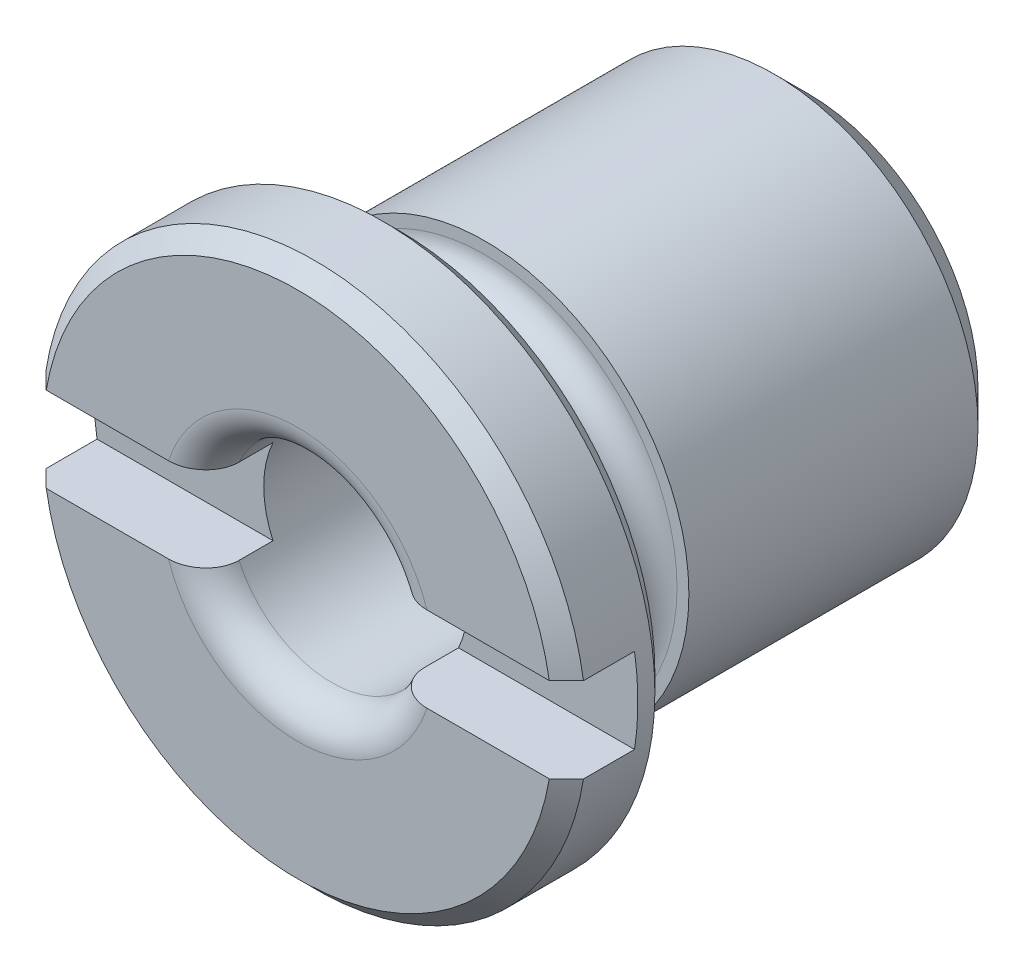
ISO-10303-21;
HEADER;
FILE_DESCRIPTION(('STEP AP214'),'2;1');
FILE_NAME('part.step','',(''),(''),'','','');
FILE_SCHEMA(('AUTOMOTIVE_DESIGN { 1 0 10303 214 1 1 1 1 }'));
ENDSEC;
DATA;
#1=APPLICATION_CONTEXT('core data for automotive mechanical design processes');
#2=APPLICATION_PROTOCOL_DEFINITION('international standard','automotive_design',2000,#1);
#3=PRODUCT_CONTEXT('',#1,'mechanical');
#4=PRODUCT('Part','Part','',(#3));
#5=PRODUCT_RELATED_PRODUCT_CATEGORY('part','',(#4));
#6=PRODUCT_DEFINITION_FORMATION('','',#4);
#7=PRODUCT_DEFINITION_CONTEXT('part definition',#1,'design');
#8=PRODUCT_DEFINITION('design','',#6,#7);
#9=PRODUCT_DEFINITION_SHAPE('','',#8);
#10=(LENGTH_UNIT() NAMED_UNIT(*) SI_UNIT(.MILLI.,.METRE.));
#11=(NAMED_UNIT(*) PLANE_ANGLE_UNIT() SI_UNIT($,.RADIAN.));
#12=(NAMED_UNIT(*) SI_UNIT($,.STERADIAN.) SOLID_ANGLE_UNIT());
#13=UNCERTAINTY_MEASURE_WITH_UNIT(LENGTH_MEASURE(1.E-05),#10,'distance_accuracy_value','');
#14=(GEOMETRIC_REPRESENTATION_CONTEXT(3) GLOBAL_UNCERTAINTY_ASSIGNED_CONTEXT((#13)) GLOBAL_UNIT_ASSIGNED_CONTEXT((#10,
#11,#12)) REPRESENTATION_CONTEXT('',''));
#15=CARTESIAN_POINT('',(0.,0.,0.));
#16=DIRECTION('',(0.,0.,1.));
#17=DIRECTION('',(1.,0.,0.));
#18=AXIS2_PLACEMENT_3D('',#15,#16,#17);
#19=CARTESIAN_POINT('',(0.,0.,-9.));
#20=DIRECTION('',(0.,0.,-1.));
#21=DIRECTION('',(0.00423805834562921,0.999991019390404,0.));
#22=AXIS2_PLACEMENT_3D('',#19,#20,#21);
#23=PLANE('',#22);
#24=CARTESIAN_POINT('',(0.,0.,-9.));
#25=DIRECTION('',(0.,0.,-1.));
#26=DIRECTION('',(-1.,0.,0.));
#27=AXIS2_PLACEMENT_3D('',#24,#25,#26);
#28=CIRCLE('',#27,4.);
#29=CARTESIAN_POINT('',(-4.,0.,-9.));
#30=VERTEX_POINT('',#29);
#31=EDGE_CURVE('E211',#30,#30,#28,.T.);
#32=ORIENTED_EDGE('',*,*,#31,.T.);
#33=EDGE_LOOP('',(#32));
#34=FACE_BOUND('',#33,.T.);
#35=ADVANCED_FACE('F14',(#34),#23,.T.);
#36=CARTESIAN_POINT('',(0.,0.,-3.5));
#37=DIRECTION('',(0.,0.,-1.));
#38=DIRECTION('',(-1.,0.,0.));
#39=AXIS2_PLACEMENT_3D('',#36,#37,#38);
#40=PLANE('',#39);
#41=CARTESIAN_POINT('',(0.,0.,-3.5));
#42=DIRECTION('',(0.,0.,-1.));
#43=DIRECTION('',(-1.,0.,0.));
#44=AXIS2_PLACEMENT_3D('',#41,#42,#43);
#45=CIRCLE('',#44,3.);
#46=CARTESIAN_POINT('',(-3.,0.,-3.5));
#47=VERTEX_POINT('',#46);
#48=EDGE_CURVE('E209',#47,#47,#45,.T.);
#49=ORIENTED_EDGE('',*,*,#48,.F.);
#50=EDGE_LOOP('',(#49));
#51=FACE_BOUND('',#50,.T.);
#52=ADVANCED_FACE('F193',(#51),#40,.F.);
#53=CARTESIAN_POINT('',(0.,0.,-17.5262382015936));
#54=DIRECTION('',(0.,0.,-1.));
#55=DIRECTION('',(-1.,0.,0.));
#56=AXIS2_PLACEMENT_3D('',#53,#54,#55);
#57=CYLINDRICAL_SURFACE('',#56,3.);
#58=DIRECTION('',(0.,0.,-1.));
#59=VECTOR('',#58,1.);
#60=CARTESIAN_POINT('',(-2.72717802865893,-1.25,-17.5262382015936));
#61=LINE('',#60,#59);
#62=CARTESIAN_POINT('',(-2.72717802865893,-1.25,1.));
#63=VERTEX_POINT('',#62);
#64=CARTESIAN_POINT('',(-2.72717802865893,-1.25,2.));
#65=VERTEX_POINT('',#64);
#66=EDGE_CURVE('E292',#63,#65,#61,.F.);
#67=ORIENTED_EDGE('',*,*,#66,.T.);
#68=CARTESIAN_POINT('',(0.,0.,2.));
#69=DIRECTION('',(0.,0.,-1.));
#70=DIRECTION('',(-1.,0.,0.));
#71=AXIS2_PLACEMENT_3D('',#68,#69,#70);
#72=CIRCLE('',#71,3.);
#73=CARTESIAN_POINT('',(2.72717802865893,-1.25,2.));
#74=VERTEX_POINT('',#73);
#75=EDGE_CURVE('E303',#65,#74,#72,.F.);
#76=ORIENTED_EDGE('',*,*,#75,.T.);
#77=DIRECTION('',(0.,0.,-1.));
#78=VECTOR('',#77,1.);
#79=CARTESIAN_POINT('',(2.72717802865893,-1.25,-17.5262382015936));
#80=LINE('',#79,#78);
#81=CARTESIAN_POINT('',(2.72717802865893,-1.25,1.));
#82=VERTEX_POINT('',#81);
#83=EDGE_CURVE('E290',#74,#82,#80,.T.);
#84=ORIENTED_EDGE('',*,*,#83,.T.);
#85=CARTESIAN_POINT('',(0.,0.,1.));
#86=DIRECTION('',(0.,0.,-1.));
#87=DIRECTION('',(0.,-1.,0.));
#88=AXIS2_PLACEMENT_3D('',#85,#86,#87);
#89=CIRCLE('',#88,3.);
#90=CARTESIAN_POINT('',(2.72717802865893,1.25,1.));
#91=VERTEX_POINT('',#90);
#92=EDGE_CURVE('E218',#82,#91,#89,.F.);
#93=ORIENTED_EDGE('',*,*,#92,.T.);
#94=DIRECTION('',(0.,0.,-1.));
#95=VECTOR('',#94,1.);
#96=CARTESIAN_POINT('',(2.72717802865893,1.25,-17.5262382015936));
#97=LINE('',#96,#95);
#98=CARTESIAN_POINT('',(2.72717802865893,1.25,2.));
#99=VERTEX_POINT('',#98);
#100=EDGE_CURVE('E285',#91,#99,#97,.F.);
#101=ORIENTED_EDGE('',*,*,#100,.T.);
#102=CARTESIAN_POINT('',(0.,0.,2.));
#103=DIRECTION('',(0.,0.,-1.));
#104=DIRECTION('',(-1.,0.,0.));
#105=AXIS2_PLACEMENT_3D('',#102,#103,#104);
#106=CIRCLE('',#105,3.);
#107=CARTESIAN_POINT('',(-2.72717802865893,1.25,2.));
#108=VERTEX_POINT('',#107);
#109=EDGE_CURVE('E305',#99,#108,#106,.F.);
#110=ORIENTED_EDGE('',*,*,#109,.T.);
#111=DIRECTION('',(0.,0.,-1.));
#112=VECTOR('',#111,1.);
#113=CARTESIAN_POINT('',(-2.72717802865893,1.25,-17.5262382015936));
#114=LINE('',#113,#112);
#115=CARTESIAN_POINT('',(-2.72717802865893,1.25,1.));
#116=VERTEX_POINT('',#115);
#117=EDGE_CURVE('E283',#108,#116,#114,.T.);
#118=ORIENTED_EDGE('',*,*,#117,.T.);
#119=EDGE_CURVE('E294',#116,#63,#89,.F.);
#120=ORIENTED_EDGE('',*,*,#119,.T.);
#121=EDGE_LOOP('',(#67,#76,#84,#93,#101,#110,#118,#120));
#122=FACE_BOUND('',#121,.T.);
#123=ORIENTED_EDGE('',*,*,#48,.T.);
#124=EDGE_LOOP('',(#123));
#125=FACE_BOUND('',#124,.T.);
#126=ADVANCED_FACE('F195',(#122,#125),#57,.F.);
#127=CARTESIAN_POINT('',(13.,-1.25,3.));
#128=DIRECTION('',(0.,-1.,0.));
#129=DIRECTION('',(0.,0.,1.));
#130=AXIS2_PLACEMENT_3D('',#127,#128,#129);
#131=PLANE('',#130);
#132=DIRECTION('',(-1.,0.,0.));
#133=VECTOR('',#132,1.);
#134=CARTESIAN_POINT('',(13.,-1.25,3.));
#135=LINE('',#134,#133);
#136=CARTESIAN_POINT('',(-3.79967103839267,-1.25,3.));
#137=VERTEX_POINT('',#136);
#138=CARTESIAN_POINT('',(-7.39509972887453,-1.25,3.));
#139=VERTEX_POINT('',#138);
#140=EDGE_CURVE('E271',#137,#139,#135,.T.);
#141=ORIENTED_EDGE('',*,*,#140,.F.);
#142=CARTESIAN_POINT('',(-3.79967103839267,-1.25,3.));
#143=CARTESIAN_POINT('',(-3.73678690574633,-1.25,3.00003379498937));
#144=CARTESIAN_POINT('',(-3.67392791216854,-1.25,2.99464950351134));
#145=CARTESIAN_POINT('',(-3.54999060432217,-1.25,2.97346188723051));
#146=CARTESIAN_POINT('',(-3.48891220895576,-1.25,2.95765903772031));
#147=CARTESIAN_POINT('',(-3.37024357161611,-1.25,2.91604545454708));
#148=CARTESIAN_POINT('',(-3.31265432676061,-1.25,2.8902318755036));
#149=CARTESIAN_POINT('',(-3.20267254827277,-1.25,2.82922762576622));
#150=CARTESIAN_POINT('',(-3.15027930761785,-1.25,2.79403823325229));
#151=CARTESIAN_POINT('',(-3.05285820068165,-1.25,2.71545576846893));
#152=CARTESIAN_POINT('',(-3.00776488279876,-1.25,2.6721440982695));
#153=CARTESIAN_POINT('',(-2.92604994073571,-1.25,2.57811291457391));
#154=CARTESIAN_POINT('',(-2.88942752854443,-1.25,2.52739409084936));
#155=CARTESIAN_POINT('',(-2.82829645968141,-1.25,2.42326776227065));
#156=CARTESIAN_POINT('',(-2.80318285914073,-1.25,2.37021564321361));
#157=CARTESIAN_POINT('',(-2.76321292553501,-1.25,2.26042484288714));
#158=CARTESIAN_POINT('',(-2.74833564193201,-1.25,2.20369395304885));
#159=CARTESIAN_POINT('',(-2.73505696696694,-1.25,2.12197393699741));
#160=CARTESIAN_POINT('',(-2.73210426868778,-1.25,2.09765852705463));
#161=CARTESIAN_POINT('',(-2.72816622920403,-1.25,2.04890006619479));
#162=CARTESIAN_POINT('',(-2.7271783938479,-1.25,2.0244572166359));
#163=CARTESIAN_POINT('',(-2.72717802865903,-1.25,2.));
#164=B_SPLINE_CURVE_WITH_KNOTS('',3,(#142,#143,#144,#145,#146,#147,#148,#149,#150,#151,#152,
#153,#154,#155,#156,#157,#158,#159,#160,#161,#162,#163),.UNSPECIFIED.,.F.,.F.,(4,2,2,2,2,2,2,2,
2,2,4),(0.,0.18838914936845,0.376769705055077,0.565203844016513,0.753612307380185,
0.940224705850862,1.12681973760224,1.30197682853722,1.47677435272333,1.55019101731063,
1.62351442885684),.UNSPECIFIED.);
#165=EDGE_CURVE('E317',#137,#65,#164,.T.);
#166=ORIENTED_EDGE('',*,*,#165,.T.);
#167=ORIENTED_EDGE('',*,*,#66,.F.);
#168=DIRECTION('',(-1.,0.,0.));
#169=VECTOR('',#168,1.);
#170=CARTESIAN_POINT('',(13.,-1.25,1.));
#171=LINE('',#170,#169);
#172=CARTESIAN_POINT('',(-7.90174031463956,-1.25,1.));
#173=VERTEX_POINT('',#172);
#174=EDGE_CURVE('E276',#63,#173,#171,.T.);
#175=ORIENTED_EDGE('',*,*,#174,.T.);
#176=DIRECTION('',(0.,0.,-1.));
#177=VECTOR('',#176,1.);
#178=CARTESIAN_POINT('',(-7.90174031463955,-1.25,-17.5262382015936));
#179=LINE('',#178,#177);
#180=CARTESIAN_POINT('',(-7.90174031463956,-1.25,2.5));
#181=VERTEX_POINT('',#180);
#182=EDGE_CURVE('E245',#181,#173,#179,.T.);
#183=ORIENTED_EDGE('',*,*,#182,.F.);
#184=CARTESIAN_POINT('',(27.9343800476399,-1.25,-17.4623333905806));
#185=CARTESIAN_POINT('',(26.8800476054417,-1.25,-16.4090660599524));
#186=CARTESIAN_POINT('',(25.8256661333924,-1.25,-15.355847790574));
#187=CARTESIAN_POINT('',(23.7166397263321,-1.25,-13.2494953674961));
#188=CARTESIAN_POINT('',(22.6619947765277,-1.25,-12.1963612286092));
#189=CARTESIAN_POINT('',(20.5477273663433,-1.25,-10.0856221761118));
#190=CARTESIAN_POINT('',(19.4881037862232,-1.25,-9.02801838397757));
#191=CARTESIAN_POINT('',(17.8984046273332,-1.25,-7.44196538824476));
#192=CARTESIAN_POINT('',(17.36848302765,-1.25,-6.91336185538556));
#193=CARTESIAN_POINT('',(16.3085054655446,-1.25,-5.85629248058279));
#194=CARTESIAN_POINT('',(15.7784495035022,-1.25,-5.32782663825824));
#195=CARTESIAN_POINT('',(14.7182251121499,-1.25,-4.27114658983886));
#196=CARTESIAN_POINT('',(14.1880567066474,-1.25,-3.74293235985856));
#197=CARTESIAN_POINT('',(13.1274621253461,-1.25,-2.68675172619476));
#198=CARTESIAN_POINT('',(12.5970359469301,-1.25,-2.15878532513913));
#199=CARTESIAN_POINT('',(11.5356810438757,-1.25,-1.1030783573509));
#200=CARTESIAN_POINT('',(11.0047522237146,-1.25,-0.575337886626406));
#201=CARTESIAN_POINT('',(9.94236178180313,-1.25,0.479566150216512));
#202=CARTESIAN_POINT('',(9.41090018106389,-1.25,1.00672973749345));
#203=CARTESIAN_POINT('',(8.34924431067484,-1.25,2.05803306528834));
#204=CARTESIAN_POINT('',(7.81905361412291,-1.25,2.58217641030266));
#205=CARTESIAN_POINT('',(7.02253617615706,-1.25,3.36722003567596));
#206=CARTESIAN_POINT('',(6.7568056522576,-1.25,3.62872509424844));
#207=CARTESIAN_POINT('',(6.22478106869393,-1.25,4.15115411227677));
#208=CARTESIAN_POINT('',(5.95848701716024,-1.25,4.41207808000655));
#209=CARTESIAN_POINT('',(5.42522113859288,-1.25,4.93293108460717));
#210=CARTESIAN_POINT('',(5.15824977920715,-1.25,5.19286060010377));
#211=CARTESIAN_POINT('',(4.62302560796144,-1.25,5.71143000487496));
#212=CARTESIAN_POINT('',(4.35477272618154,-1.25,5.97006982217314));
#213=CARTESIAN_POINT('',(3.95082930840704,-1.25,6.35632620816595));
#214=CARTESIAN_POINT('',(3.81593807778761,-1.25,6.48477821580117));
#215=CARTESIAN_POINT('',(3.54543320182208,-1.25,6.74091878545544));
#216=CARTESIAN_POINT('',(3.40981956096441,-1.25,6.8686073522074));
#217=CARTESIAN_POINT('',(3.13760998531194,-1.25,7.12290966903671));
#218=CARTESIAN_POINT('',(3.00101413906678,-1.25,7.24952351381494));
#219=CARTESIAN_POINT('',(2.72640859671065,-1.25,7.50120683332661));
#220=CARTESIAN_POINT('',(2.58839895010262,-1.25,7.62627636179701));
#221=CARTESIAN_POINT('',(2.41149252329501,-1.25,7.78384336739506));
#222=CARTESIAN_POINT('',(2.37358311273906,-1.25,7.81744965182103));
#223=CARTESIAN_POINT('',(2.29758289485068,-1.25,7.88445711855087));
#224=CARTESIAN_POINT('',(2.25949208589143,-1.25,7.91785829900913));
#225=CARTESIAN_POINT('',(2.14490683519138,-1.25,8.01771925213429));
#226=CARTESIAN_POINT('',(2.0681069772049,-1.25,8.08382982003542));
#227=CARTESIAN_POINT('',(1.91297050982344,-1.25,8.21521518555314));
#228=CARTESIAN_POINT('',(1.83462731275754,-1.25,8.28048222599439));
#229=CARTESIAN_POINT('',(1.67654078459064,-1.25,8.4092623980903));
#230=CARTESIAN_POINT('',(1.5967978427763,-1.25,8.47277600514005));
#231=CARTESIAN_POINT('',(1.43449799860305,-1.25,8.59800601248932));
#232=CARTESIAN_POINT('',(1.35191980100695,-1.25,8.65969498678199));
#233=CARTESIAN_POINT('',(1.18390135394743,-1.25,8.77935164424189));
#234=CARTESIAN_POINT('',(1.09845744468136,-1.25,8.83731426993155));
#235=CARTESIAN_POINT('',(0.924443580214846,-1.25,8.94676771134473));
#236=CARTESIAN_POINT('',(0.835904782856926,-1.25,8.99830742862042));
#237=CARTESIAN_POINT('',(0.653805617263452,-1.25,9.09149723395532));
#238=CARTESIAN_POINT('',(0.560261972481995,-1.25,9.13317800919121));
#239=CARTESIAN_POINT('',(0.426967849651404,-1.25,9.17954037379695));
#240=CARTESIAN_POINT('',(0.38964389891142,-1.25,9.19118167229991));
#241=CARTESIAN_POINT('',(0.314212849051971,-1.25,9.21162478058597));
#242=CARTESIAN_POINT('',(0.276105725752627,-1.25,9.22042650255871));
#243=CARTESIAN_POINT('',(0.199412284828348,-1.25,9.23475182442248));
#244=CARTESIAN_POINT('',(0.160828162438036,-1.25,9.24028701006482));
#245=CARTESIAN_POINT('',(0.0833175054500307,-1.25,9.24781985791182));
#246=CARTESIAN_POINT('',(0.0443910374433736,-1.25,9.24981819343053));
#247=CARTESIAN_POINT('',(-0.0336350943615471,-1.25,9.25015867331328));
#248=CARTESIAN_POINT('',(-0.0727348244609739,-1.25,9.24848606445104));
#249=CARTESIAN_POINT('',(-0.150612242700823,-1.25,9.24155698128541));
#250=CARTESIAN_POINT('',(-0.1893899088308,-1.25,9.23630026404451));
#251=CARTESIAN_POINT('',(-0.266469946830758,-1.25,9.22247794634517));
#252=CARTESIAN_POINT('',(-0.304770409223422,-1.25,9.21390185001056));
#253=CARTESIAN_POINT('',(-0.380596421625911,-1.25,9.19385439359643));
#254=CARTESIAN_POINT('',(-0.418121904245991,-1.25,9.18238278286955));
#255=CARTESIAN_POINT('',(-0.535070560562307,-1.25,9.14236918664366));
#256=CARTESIAN_POINT('',(-0.612972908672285,-1.25,9.1093833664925));
#257=CARTESIAN_POINT('',(-0.765172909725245,-1.25,9.0359212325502));
#258=CARTESIAN_POINT('',(-0.839463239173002,-1.25,8.99543044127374));
#259=CARTESIAN_POINT('',(-0.985690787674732,-1.25,8.90922028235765));
#260=CARTESIAN_POINT('',(-1.05760516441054,-1.25,8.86346263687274));
#261=CARTESIAN_POINT('',(-1.16373455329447,-1.25,8.79234173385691));
#262=CARTESIAN_POINT('',(-1.19880604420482,-1.25,8.76823152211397));
#263=CARTESIAN_POINT('',(-1.26845472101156,-1.25,8.71930841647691));
#264=CARTESIAN_POINT('',(-1.30303192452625,-1.25,8.69449554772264));
#265=CARTESIAN_POINT('',(-1.41266915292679,-1.25,8.61440156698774));
#266=CARTESIAN_POINT('',(-1.48691997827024,-1.25,8.55801372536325));
#267=CARTESIAN_POINT('',(-1.63390691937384,-1.25,8.44329142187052));
#268=CARTESIAN_POINT('',(-1.7066428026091,-1.25,8.38495666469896));
#269=CARTESIAN_POINT('',(-1.85099259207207,-1.25,8.26685180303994));
#270=CARTESIAN_POINT('',(-1.92260596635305,-1.25,8.20708105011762));
#271=CARTESIAN_POINT('',(-2.06494026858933,-1.25,8.08648452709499));
#272=CARTESIAN_POINT('',(-2.13566116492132,-1.25,8.02565871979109));
#273=CARTESIAN_POINT('',(-2.34702175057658,-1.25,7.84177923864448));
#274=CARTESIAN_POINT('',(-2.48661620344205,-1.25,7.71752553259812));
#275=CARTESIAN_POINT('',(-2.76397886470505,-1.25,7.46708552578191));
#276=CARTESIAN_POINT('',(-2.90174756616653,-1.25,7.34089976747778));
#277=CARTESIAN_POINT('',(-3.17560264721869,-1.25,7.08763269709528));
#278=CARTESIAN_POINT('',(-3.31169311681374,-1.25,6.96055580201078));
#279=CARTESIAN_POINT('',(-3.58302052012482,-1.25,6.70547691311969));
#280=CARTESIAN_POINT('',(-3.71825739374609,-1.25,6.57747485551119));
#281=CARTESIAN_POINT('',(-3.9879571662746,-1.25,6.32093623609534));
#282=CARTESIAN_POINT('',(-4.12242071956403,-1.25,6.19240036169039));
#283=CARTESIAN_POINT('',(-4.39086416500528,-1.25,5.93483121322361));
#284=CARTESIAN_POINT('',(-4.52484406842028,-1.25,5.8057979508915));
#285=CARTESIAN_POINT('',(-4.92512166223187,-1.25,5.41920199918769));
#286=CARTESIAN_POINT('',(-5.19087495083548,-1.25,5.16107581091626));
#287=CARTESIAN_POINT('',(-5.72146030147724,-1.25,4.64387793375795));
#288=CARTESIAN_POINT('',(-5.9862923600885,-1.25,4.38480624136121));
#289=CARTESIAN_POINT('',(-6.77988063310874,-1.25,3.60664685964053));
#290=CARTESIAN_POINT('',(-7.30771950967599,-1.25,3.08662403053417));
#291=CARTESIAN_POINT('',(-8.36237458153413,-1.25,2.0451104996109));
#292=CARTESIAN_POINT('',(-8.88919026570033,-1.25,1.52361928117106));
#293=CARTESIAN_POINT('',(-9.94207527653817,-1.25,0.479892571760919));
#294=CARTESIAN_POINT('',(-10.4681446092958,-1.25,-0.0423429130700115));
#295=CARTESIAN_POINT('',(-11.5199752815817,-1.25,-1.08744281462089));
#296=CARTESIAN_POINT('',(-12.0457364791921,-1.25,-1.61030737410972));
#297=CARTESIAN_POINT('',(-13.0969425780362,-1.25,-2.65635663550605));
#298=CARTESIAN_POINT('',(-13.6223874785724,-1.25,-3.17954133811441));
#299=CARTESIAN_POINT('',(-15.1982511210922,-1.25,-4.74928460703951));
#300=CARTESIAN_POINT('',(-16.248340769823,-1.25,-5.79617351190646));
#301=CARTESIAN_POINT('',(-18.617113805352,-1.25,-8.15879167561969));
#302=CARTESIAN_POINT('',(-19.9356606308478,-1.25,-9.47465781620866));
#303=CARTESIAN_POINT('',(-22.5723454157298,-1.25,-12.1068003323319));
#304=CARTESIAN_POINT('',(-23.8904833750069,-1.25,-13.4230767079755));
#305=CARTESIAN_POINT('',(-27.8446847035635,-1.25,-17.3724153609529));
#306=CARTESIAN_POINT('',(-30.4803870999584,-1.25,-20.0058390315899));
#307=CARTESIAN_POINT('',(-35.7492026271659,-1.25,-25.2709182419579));
#308=CARTESIAN_POINT('',(-38.3823160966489,-1.25,-27.9025734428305));
#309=CARTESIAN_POINT('',(-43.6481495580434,-1.25,-33.1659789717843));
#310=CARTESIAN_POINT('',(-46.2808695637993,-1.25,-35.7977292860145));
#311=CARTESIAN_POINT('',(-48.9135498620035,-1.25,-38.4295193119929));
#312=B_SPLINE_CURVE_WITH_KNOTS('',3,(#184,#185,#186,#187,#188,#189,#190,#191,#192,#193,#194,
#195,#196,#197,#198,#199,#200,#201,#202,#203,#204,#205,#206,#207,#208,#209,#210,#211,#212,#213,
#214,#215,#216,#217,#218,#219,#220,#221,#222,#223,#224,#225,#226,#227,#228,#229,#230,#231,#232,
#233,#234,#235,#236,#237,#238,#239,#240,#241,#242,#243,#244,#245,#246,#247,#248,#249,#250,#251,
#252,#253,#254,#255,#256,#257,#258,#259,#260,#261,#262,#263,#264,#265,#266,#267,#268,#269,#270,
#271,#272,#273,#274,#275,#276,#277,#278,#279,#280,#281,#282,#283,#284,#285,#286,#287,#288,#289,
#290,#291,#292,#293,#294,#295,#296,#297,#298,#299,#300,#301,#302,#303,#304,#305,#306,#307,#308,
#309,#310,#311),.UNSPECIFIED.,.F.,.F.,(4,2,2,2,2,2,2,2,2,2,2,2,2,2,2,2,2,2,2,2,2,2,2,2,2,2,2,2,
2,2,2,2,2,2,2,2,2,2,2,2,2,2,2,2,2,2,2,2,2,2,2,2,2,2,2,2,2,2,2,2,2,2,2,4),(0.,4.47089486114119,
8.94217065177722,13.4334901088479,15.6789627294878,17.9244290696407,20.169601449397,
22.4147971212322,24.6605837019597,26.9062849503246,29.1428996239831,30.2613705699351,
31.3798254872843,32.4976488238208,33.6155338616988,34.174334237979,34.7331311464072,
35.2918782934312,35.8506059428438,36.002587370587,36.1545701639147,36.4585655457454,
36.7644519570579,37.0702546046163,37.3794183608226,37.6889932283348,37.9960447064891,
38.3021274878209,38.4193280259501,38.5365321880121,38.65331811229,38.7700818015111,
38.8873156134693,39.0045573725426,39.1221729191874,39.2397986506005,39.4928942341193,
39.7464832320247,40.0020479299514,40.1297212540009,40.2573900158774,40.5370425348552,
40.8167376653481,41.0965615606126,41.3763953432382,41.9370109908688,42.4974720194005,
43.0560552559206,43.6146773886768,44.1727233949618,44.7307563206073,45.8421858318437,
46.9536194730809,49.1765262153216,51.4003490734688,53.6241536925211,55.8486331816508,
58.0731175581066,62.5214856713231,68.1099222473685,73.6983603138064,84.8758655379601,
96.0441268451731,107.21175500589),.UNSPECIFIED.);
#313=EDGE_CURVE('E253',#181,#139,#312,.F.);
#314=ORIENTED_EDGE('',*,*,#313,.T.);
#315=EDGE_LOOP('',(#141,#166,#167,#175,#183,#314));
#316=FACE_BOUND('',#315,.T.);
#317=ADVANCED_FACE('F203',(#316),#131,.F.);
#318=CARTESIAN_POINT('',(0.,0.,2.));
#319=DIRECTION('',(0.,0.,-1.));
#320=DIRECTION('',(-1.,0.,0.));
#321=AXIS2_PLACEMENT_3D('',#318,#319,#320);
#322=TOROIDAL_SURFACE('',#321,4.,1.);
#323=CARTESIAN_POINT('',(2.72717802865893,-1.25,2.));
#324=CARTESIAN_POINT('',(2.72717637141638,-1.25,2.02647112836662));
#325=CARTESIAN_POINT('',(2.72833510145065,-1.25,2.05292861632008));
#326=CARTESIAN_POINT('',(2.73294553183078,-1.25,2.10563537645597));
#327=CARTESIAN_POINT('',(2.7363965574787,-1.25,2.13188470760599));
#328=CARTESIAN_POINT('',(2.75010667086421,-1.25,2.20984088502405));
#329=CARTESIAN_POINT('',(2.76372335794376,-1.25,2.2609943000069));
#330=CARTESIAN_POINT('',(2.79927265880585,-1.25,2.36023500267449));
#331=CARTESIAN_POINT('',(2.82119951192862,-1.25,2.40832438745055));
#332=CARTESIAN_POINT('',(2.87248281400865,-1.25,2.50039112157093));
#333=CARTESIAN_POINT('',(2.90184449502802,-1.25,2.54436554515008));
#334=CARTESIAN_POINT('',(2.96842469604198,-1.25,2.62910886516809));
#335=CARTESIAN_POINT('',(3.00593454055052,-1.25,2.66964825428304));
#336=CARTESIAN_POINT('',(3.08676459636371,-1.25,2.74444380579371));
#337=CARTESIAN_POINT('',(3.13008668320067,-1.25,2.77869793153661));
#338=CARTESIAN_POINT('',(3.22511899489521,-1.25,2.84283209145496));
#339=CARTESIAN_POINT('',(3.27722544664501,-1.25,2.87212546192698));
#340=CARTESIAN_POINT('',(3.38543968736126,-1.25,2.92203100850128));
#341=CARTESIAN_POINT('',(3.44154755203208,-1.25,2.94264302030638));
#342=CARTESIAN_POINT('',(3.54782721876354,-1.25,2.97234347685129));
#343=CARTESIAN_POINT('',(3.59765331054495,-1.25,2.98268350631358));
#344=CARTESIAN_POINT('',(3.69820345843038,-1.25,2.99651507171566));
#345=CARTESIAN_POINT('',(3.74892673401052,-1.25,3.00001229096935));
#346=CARTESIAN_POINT('',(3.79967103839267,-1.25,3.));
#347=B_SPLINE_CURVE_WITH_KNOTS('',3,(#323,#324,#325,#326,#327,#328,#329,#330,#331,#332,#333,
#334,#335,#336,#337,#338,#339,#340,#341,#342,#343,#344,#345,#346),.UNSPECIFIED.,.F.,.F.,(4,2,2,
2,2,2,2,2,2,2,2,4),(0.,0.0793614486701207,0.158699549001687,0.316670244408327,0.474531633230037,
0.632504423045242,0.797502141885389,0.962553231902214,1.14109988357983,1.31964991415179,
1.47185401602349,1.6239316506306),.UNSPECIFIED.);
#348=CARTESIAN_POINT('',(3.79967103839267,-1.25,3.));
#349=VERTEX_POINT('',#348);
#350=EDGE_CURVE('E266',#74,#349,#347,.T.);
#351=ORIENTED_EDGE('',*,*,#350,.F.);
#352=ORIENTED_EDGE('',*,*,#75,.F.);
#353=ORIENTED_EDGE('',*,*,#165,.F.);
#354=CARTESIAN_POINT('',(0.,0.,3.));
#355=DIRECTION('',(0.,0.,-1.));
#356=DIRECTION('',(-1.,0.,0.));
#357=AXIS2_PLACEMENT_3D('',#354,#355,#356);
#358=CIRCLE('',#357,4.);
#359=EDGE_CURVE('E304',#349,#137,#358,.T.);
#360=ORIENTED_EDGE('',*,*,#359,.F.);
#361=EDGE_LOOP('',(#351,#352,#353,#360));
#362=FACE_BOUND('',#361,.T.);
#363=ADVANCED_FACE('F180',(#362),#322,.T.);
#364=ORIENTED_EDGE('',*,*,#83,.F.);
#365=ORIENTED_EDGE('',*,*,#350,.T.);
#366=CARTESIAN_POINT('',(7.39509972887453,-1.25,3.));
#367=VERTEX_POINT('',#366);
#368=EDGE_CURVE('E264',#367,#349,#135,.T.);
#369=ORIENTED_EDGE('',*,*,#368,.F.);
#370=CARTESIAN_POINT('',(7.90174031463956,-1.25,2.5));
#371=VERTEX_POINT('',#370);
#372=EDGE_CURVE('E115',#367,#371,#312,.F.);
#373=ORIENTED_EDGE('',*,*,#372,.T.);
#374=DIRECTION('',(0.,0.,-1.));
#375=VECTOR('',#374,1.);
#376=CARTESIAN_POINT('',(7.90174031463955,-1.25,-17.5262382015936));
#377=LINE('',#376,#375);
#378=CARTESIAN_POINT('',(7.90174031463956,-1.25,1.));
#379=VERTEX_POINT('',#378);
#380=EDGE_CURVE('E246',#379,#371,#377,.F.);
#381=ORIENTED_EDGE('',*,*,#380,.F.);
#382=EDGE_CURVE('E274',#379,#82,#171,.T.);
#383=ORIENTED_EDGE('',*,*,#382,.T.);
#384=EDGE_LOOP('',(#364,#365,#369,#373,#381,#383));
#385=FACE_BOUND('',#384,.T.);
#386=ADVANCED_FACE('F260',(#385),#131,.F.);
#387=CARTESIAN_POINT('',(13.,1.25,1.));
#388=DIRECTION('',(0.,0.,-1.));
#389=DIRECTION('',(0.,-1.,0.));
#390=AXIS2_PLACEMENT_3D('',#387,#388,#389);
#391=PLANE('',#390);
#392=ORIENTED_EDGE('',*,*,#382,.F.);
#393=CARTESIAN_POINT('',(0.,0.,1.));
#394=DIRECTION('',(0.,0.,-1.));
#395=DIRECTION('',(0.,-1.,0.));
#396=AXIS2_PLACEMENT_3D('',#393,#394,#395);
#397=CIRCLE('',#396,8.);
#398=CARTESIAN_POINT('',(7.90174031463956,1.25,1.));
#399=VERTEX_POINT('',#398);
#400=EDGE_CURVE('E257',#399,#379,#397,.T.);
#401=ORIENTED_EDGE('',*,*,#400,.F.);
#402=DIRECTION('',(-1.,0.,0.));
#403=VECTOR('',#402,1.);
#404=CARTESIAN_POINT('',(13.,1.25,1.));
#405=LINE('',#404,#403);
#406=EDGE_CURVE('E279',#399,#91,#405,.T.);
#407=ORIENTED_EDGE('',*,*,#406,.T.);
#408=ORIENTED_EDGE('',*,*,#92,.F.);
#409=EDGE_LOOP('',(#392,#401,#407,#408));
#410=FACE_BOUND('',#409,.T.);
#411=ADVANCED_FACE('F157',(#410),#391,.F.);
#412=CARTESIAN_POINT('',(13.,1.25,3.));
#413=DIRECTION('',(0.,1.,0.));
#414=DIRECTION('',(0.,0.,-1.));
#415=AXIS2_PLACEMENT_3D('',#412,#413,#414);
#416=PLANE('',#415);
#417=DIRECTION('',(-1.,0.,0.));
#418=VECTOR('',#417,1.);
#419=CARTESIAN_POINT('',(13.,1.25,3.));
#420=LINE('',#419,#418);
#421=CARTESIAN_POINT('',(7.39509972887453,1.25,3.));
#422=VERTEX_POINT('',#421);
#423=CARTESIAN_POINT('',(3.79967103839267,1.25,3.));
#424=VERTEX_POINT('',#423);
#425=EDGE_CURVE('E107',#422,#424,#420,.T.);
#426=ORIENTED_EDGE('',*,*,#425,.T.);
#427=CARTESIAN_POINT('',(3.79967103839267,1.25,3.));
#428=CARTESIAN_POINT('',(3.73678690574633,1.25,3.00003379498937));
#429=CARTESIAN_POINT('',(3.67392791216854,1.25,2.99464950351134));
#430=CARTESIAN_POINT('',(3.54999060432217,1.25,2.97346188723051));
#431=CARTESIAN_POINT('',(3.48891220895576,1.25,2.95765903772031));
#432=CARTESIAN_POINT('',(3.37024357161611,1.25,2.91604545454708));
#433=CARTESIAN_POINT('',(3.31265432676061,1.25,2.8902318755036));
#434=CARTESIAN_POINT('',(3.20267254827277,1.25,2.82922762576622));
#435=CARTESIAN_POINT('',(3.15027930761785,1.25,2.79403823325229));
#436=CARTESIAN_POINT('',(3.05285820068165,1.25,2.71545576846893));
#437=CARTESIAN_POINT('',(3.00776488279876,1.25,2.6721440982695));
#438=CARTESIAN_POINT('',(2.92604994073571,1.25,2.57811291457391));
#439=CARTESIAN_POINT('',(2.88942752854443,1.25,2.52739409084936));
#440=CARTESIAN_POINT('',(2.82829645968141,1.25,2.42326776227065));
#441=CARTESIAN_POINT('',(2.80318285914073,1.25,2.37021564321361));
#442=CARTESIAN_POINT('',(2.76321292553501,1.25,2.26042484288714));
#443=CARTESIAN_POINT('',(2.74833564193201,1.25,2.20369395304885));
#444=CARTESIAN_POINT('',(2.73505696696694,1.25,2.12197393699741));
#445=CARTESIAN_POINT('',(2.73210426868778,1.25,2.09765852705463));
#446=CARTESIAN_POINT('',(2.72816622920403,1.25,2.04890006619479));
#447=CARTESIAN_POINT('',(2.7271783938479,1.25,2.0244572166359));
#448=CARTESIAN_POINT('',(2.72717802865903,1.25,2.));
#449=B_SPLINE_CURVE_WITH_KNOTS('',3,(#427,#428,#429,#430,#431,#432,#433,#434,#435,#436,#437,
#438,#439,#440,#441,#442,#443,#444,#445,#446,#447,#448),.UNSPECIFIED.,.F.,.F.,(4,2,2,2,2,2,2,2,
2,2,4),(0.,0.18838914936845,0.376769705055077,0.565203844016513,0.753612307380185,
0.940224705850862,1.12681973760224,1.30197682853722,1.47677435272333,1.55019101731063,
1.62351442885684),.UNSPECIFIED.);
#450=EDGE_CURVE('E28',#424,#99,#449,.T.);
#451=ORIENTED_EDGE('',*,*,#450,.T.);
#452=ORIENTED_EDGE('',*,*,#100,.F.);
#453=ORIENTED_EDGE('',*,*,#406,.F.);
#454=DIRECTION('',(0.,0.,-1.));
#455=VECTOR('',#454,1.);
#456=CARTESIAN_POINT('',(7.90174031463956,1.25,-17.5262382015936));
#457=LINE('',#456,#455);
#458=CARTESIAN_POINT('',(7.90174031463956,1.25,2.5));
#459=VERTEX_POINT('',#458);
#460=EDGE_CURVE('E110',#459,#399,#457,.T.);
#461=ORIENTED_EDGE('',*,*,#460,.F.);
#462=CARTESIAN_POINT('',(48.5840654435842,1.24999999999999,-38.1001431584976));
#463=CARTESIAN_POINT('',(46.8285387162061,1.24999999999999,-36.3452029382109));
#464=CARTESIAN_POINT('',(45.0729858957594,1.24999999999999,-34.5902888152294));
#465=CARTESIAN_POINT('',(41.5617892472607,1.24999999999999,-31.0805497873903));
#466=CARTESIAN_POINT('',(39.8061454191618,1.24999999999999,-29.3257248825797));
#467=CARTESIAN_POINT('',(36.2942409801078,1.24999999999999,-25.8157146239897));
#468=CARTESIAN_POINT('',(34.5379803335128,1.24999999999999,-24.0605293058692));
#469=CARTESIAN_POINT('',(31.0252610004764,1.24999999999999,-20.5503586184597));
#470=CARTESIAN_POINT('',(29.2688023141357,1.24999999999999,-18.7953732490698));
#471=CARTESIAN_POINT('',(25.911480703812,1.24999999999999,-15.4415127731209));
#472=CARTESIAN_POINT('',(24.3106464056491,1.24999999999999,-13.8426090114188));
#473=CARTESIAN_POINT('',(21.1084931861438,1.25,-10.6452821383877));
#474=CARTESIAN_POINT('',(19.507174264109,1.25,-9.04685902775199));
#475=CARTESIAN_POINT('',(17.1046534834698,1.25,-6.65017934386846));
#476=CARTESIAN_POINT('',(16.3038257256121,1.25,-5.85154780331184));
#477=CARTESIAN_POINT('',(14.7017762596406,1.25,-4.25467913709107));
#478=CARTESIAN_POINT('',(13.9005545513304,1.25,-3.45644201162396));
#479=CARTESIAN_POINT('',(12.2974800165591,1.25,-1.86060598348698));
#480=CARTESIAN_POINT('',(11.4956271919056,1.25,-1.06300707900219));
#481=CARTESIAN_POINT('',(10.2919671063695,1.25,0.13250388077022));
#482=CARTESIAN_POINT('',(9.89060043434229,1.25,0.530859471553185));
#483=CARTESIAN_POINT('',(9.08744225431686,1.25,1.32714208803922));
#484=CARTESIAN_POINT('',(8.68565074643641,1.25,1.72506911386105));
#485=CARTESIAN_POINT('',(7.98169836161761,1.25,2.42113919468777));
#486=CARTESIAN_POINT('',(7.67967596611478,1.25,2.71942227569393));
#487=CARTESIAN_POINT('',(7.07497291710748,1.25,3.31562989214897));
#488=CARTESIAN_POINT('',(6.77229200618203,1.25,3.61355416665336));
#489=CARTESIAN_POINT('',(6.16162167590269,1.25,4.21313484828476));
#490=CARTESIAN_POINT('',(5.8536210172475,1.25,4.5147798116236));
#491=CARTESIAN_POINT('',(5.23692499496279,1.25,5.11639390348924));
#492=CARTESIAN_POINT('',(4.92823147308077,1.25,5.41636491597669));
#493=CARTESIAN_POINT('',(4.46282023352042,1.25,5.86560216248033));
#494=CARTESIAN_POINT('',(4.30685142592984,1.25,6.01564379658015));
#495=CARTESIAN_POINT('',(3.99418823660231,1.25,6.31502754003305));
#496=CARTESIAN_POINT('',(3.83749372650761,1.25,6.46436951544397));
#497=CARTESIAN_POINT('',(3.52220216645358,1.25,6.76291387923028));
#498=CARTESIAN_POINT('',(3.36359934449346,1.25,6.91211018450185));
#499=CARTESIAN_POINT('',(3.04506502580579,1.25,7.20886524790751));
#500=CARTESIAN_POINT('',(2.88513448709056,1.25,7.3564250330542));
#501=CARTESIAN_POINT('',(2.56614170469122,1.25,7.64637452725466));
#502=CARTESIAN_POINT('',(2.40712064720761,1.25,7.78880920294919));
#503=CARTESIAN_POINT('',(2.16578061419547,1.25,7.99968001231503));
#504=CARTESIAN_POINT('',(2.08475760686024,1.25,8.06959672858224));
#505=CARTESIAN_POINT('',(1.92156080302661,1.25,8.20805351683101));
#506=CARTESIAN_POINT('',(1.83938718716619,1.25,8.27659380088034));
#507=CARTESIAN_POINT('',(1.67441928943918,1.25,8.41100133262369));
#508=CARTESIAN_POINT('',(1.59164258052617,1.25,8.47689006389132));
#509=CARTESIAN_POINT('',(1.4239292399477,1.25,8.60600981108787));
#510=CARTESIAN_POINT('',(1.33899117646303,1.25,8.66923898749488));
#511=CARTESIAN_POINT('',(1.16656955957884,1.25,8.79129288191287));
#512=CARTESIAN_POINT('',(1.07909936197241,1.25,8.85013634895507));
#513=CARTESIAN_POINT('',(0.900108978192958,1.25,8.96124863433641));
#514=CARTESIAN_POINT('',(0.808595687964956,1.25,9.01352810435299));
#515=CARTESIAN_POINT('',(0.693886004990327,1.25,9.0704305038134));
#516=CARTESIAN_POINT('',(0.6732972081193,1.25,9.08031930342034));
#517=CARTESIAN_POINT('',(0.631840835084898,1.25,9.09950600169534));
#518=CARTESIAN_POINT('',(0.610973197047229,1.25,9.10880376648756));
#519=CARTESIAN_POINT('',(0.547926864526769,1.25,9.13571290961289));
#520=CARTESIAN_POINT('',(0.505316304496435,1.25,9.152334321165));
#521=CARTESIAN_POINT('',(0.419242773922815,1.25,9.18218084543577));
#522=CARTESIAN_POINT('',(0.375787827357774,1.25,9.19542885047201));
#523=CARTESIAN_POINT('',(0.287874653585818,1.25,9.2179811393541));
#524=CARTESIAN_POINT('',(0.243417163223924,1.25,9.22728822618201));
#525=CARTESIAN_POINT('',(0.16579313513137,1.25,9.23947003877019));
#526=CARTESIAN_POINT('',(0.132791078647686,1.25,9.24339985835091));
#527=CARTESIAN_POINT('',(0.0665269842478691,1.25,9.24866719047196));
#528=CARTESIAN_POINT('',(0.0332646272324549,1.25,9.2500007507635));
#529=CARTESIAN_POINT('',(-0.0380155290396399,1.25,9.24999914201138));
#530=CARTESIAN_POINT('',(-0.0760340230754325,1.25,9.24825561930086));
#531=CARTESIAN_POINT('',(-0.151770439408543,1.25,9.24138686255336));
#532=CARTESIAN_POINT('',(-0.189488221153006,1.25,9.2362601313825));
#533=CARTESIAN_POINT('',(-0.301856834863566,1.25,9.2161762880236));
#534=CARTESIAN_POINT('',(-0.375682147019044,1.25,9.196515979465));
#535=CARTESIAN_POINT('',(-0.526508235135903,1.25,9.14568396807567));
#536=CARTESIAN_POINT('',(-0.603196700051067,1.25,9.11363539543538));
#537=CARTESIAN_POINT('',(-0.753119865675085,1.25,9.0421433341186));
#538=CARTESIAN_POINT('',(-0.826347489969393,1.25,9.00268545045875));
#539=CARTESIAN_POINT('',(-0.970554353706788,1.25,8.91853947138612));
#540=CARTESIAN_POINT('',(-1.04150786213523,1.25,8.87380805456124));
#541=CARTESIAN_POINT('',(-1.14621679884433,1.25,8.80422841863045));
#542=CARTESIAN_POINT('',(-1.18081861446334,1.25,8.78063196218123));
#543=CARTESIAN_POINT('',(-1.24953161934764,1.25,8.7327361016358));
#544=CARTESIAN_POINT('',(-1.28364282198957,1.25,8.70843671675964));
#545=CARTESIAN_POINT('',(-1.3915260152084,1.25,8.63017606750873));
#546=CARTESIAN_POINT('',(-1.46450070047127,1.25,8.57511644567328));
#547=CARTESIAN_POINT('',(-1.60894787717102,1.25,8.46305491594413));
#548=CARTESIAN_POINT('',(-1.68042013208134,1.25,8.40605270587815));
#549=CARTESIAN_POINT('',(-1.82224845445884,1.25,8.29061286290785));
#550=CARTESIAN_POINT('',(-1.89260398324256,1.25,8.23217456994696));
#551=CARTESIAN_POINT('',(-2.0324247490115,1.25,8.11424073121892));
#552=CARTESIAN_POINT('',(-2.1018899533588,1.25,8.05474514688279));
#553=CARTESIAN_POINT('',(-2.30948452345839,1.25,7.87485182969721));
#554=CARTESIAN_POINT('',(-2.44656870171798,1.25,7.75324939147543));
#555=CARTESIAN_POINT('',(-2.71890476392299,1.25,7.50809953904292));
#556=CARTESIAN_POINT('',(-2.85415715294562,1.25,7.38455268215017));
#557=CARTESIAN_POINT('',(-3.12293582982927,1.25,7.13658627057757));
#558=CARTESIAN_POINT('',(-3.25646664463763,1.25,7.01217161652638));
#559=CARTESIAN_POINT('',(-3.52266900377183,1.25,6.76240935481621));
#560=CARTESIAN_POINT('',(-3.65534048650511,1.25,6.63706168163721));
#561=CARTESIAN_POINT('',(-3.91990341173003,1.25,6.38582605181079));
#562=CARTESIAN_POINT('',(-4.0517955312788,1.25,6.25993880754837));
#563=CARTESIAN_POINT('',(-4.31509170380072,1.25,6.00766163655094));
#564=CARTESIAN_POINT('',(-4.446495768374,1.25,5.88127172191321));
#565=CARTESIAN_POINT('',(-4.83903459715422,1.25,5.50260347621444));
#566=CARTESIAN_POINT('',(-5.09961956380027,1.25,5.24975538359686));
#567=CARTESIAN_POINT('',(-5.61985761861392,1.25,4.74310188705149));
#568=CARTESIAN_POINT('',(-5.87951070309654,1.25,4.48929647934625));
#569=CARTESIAN_POINT('',(-6.65755057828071,1.25,3.72692318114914));
#570=CARTESIAN_POINT('',(-7.17500834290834,1.25,3.21740757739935));
#571=CARTESIAN_POINT('',(-8.20888516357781,1.25,2.19688808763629));
#572=CARTESIAN_POINT('',(-8.72530368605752,1.25,1.68588366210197));
#573=CARTESIAN_POINT('',(-9.75738288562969,1.25,0.663118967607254));
#574=CARTESIAN_POINT('',(-10.2730435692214,1.25,0.151358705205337));
#575=CARTESIAN_POINT('',(-11.3041095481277,1.25,-0.872858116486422));
#576=CARTESIAN_POINT('',(-11.8195146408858,1.25,-1.38531487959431));
#577=CARTESIAN_POINT('',(-12.850003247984,1.25,-2.41055398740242));
#578=CARTESIAN_POINT('',(-13.3650867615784,1.25,-2.92333633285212));
#579=CARTESIAN_POINT('',(-14.9098587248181,1.25,-4.46187652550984));
#580=CARTESIAN_POINT('',(-15.9392123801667,1.25,-5.48797048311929));
#581=CARTESIAN_POINT('',(-18.2874791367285,1.25,-7.8298966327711));
#582=CARTESIAN_POINT('',(-19.6062377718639,1.25,-9.14588366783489));
#583=CARTESIAN_POINT('',(-22.2433272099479,1.24999999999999,-11.7782870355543));
#584=CARTESIAN_POINT('',(-23.5616580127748,1.24999999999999,-13.094703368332));
#585=CARTESIAN_POINT('',(-27.5164291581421,1.24999999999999,-17.0444815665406));
#586=CARTESIAN_POINT('',(-30.1524943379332,1.24999999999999,-19.6782190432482));
#587=CARTESIAN_POINT('',(-35.421352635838,1.24999999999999,-24.9432668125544));
#588=CARTESIAN_POINT('',(-38.0541462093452,1.24999999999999,-27.5745766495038));
#589=CARTESIAN_POINT('',(-43.3193283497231,1.24999999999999,-32.8372920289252));
#590=CARTESIAN_POINT('',(-45.9517169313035,1.24999999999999,-35.4686975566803));
#591=CARTESIAN_POINT('',(-48.5840654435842,1.24999999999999,-38.1001431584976));
#592=B_SPLINE_CURVE_WITH_KNOTS('',3,(#462,#463,#464,#465,#466,#467,#468,#469,#470,#471,#472,
#473,#474,#475,#476,#477,#478,#479,#480,#481,#482,#483,#484,#485,#486,#487,#488,#489,#490,#491,
#492,#493,#494,#495,#496,#497,#498,#499,#500,#501,#502,#503,#504,#505,#506,#507,#508,#509,#510,
#511,#512,#513,#514,#515,#516,#517,#518,#519,#520,#521,#522,#523,#524,#525,#526,#527,#528,#529,
#530,#531,#532,#533,#534,#535,#536,#537,#538,#539,#540,#541,#542,#543,#544,#545,#546,#547,#548,
#549,#550,#551,#552,#553,#554,#555,#556,#557,#558,#559,#560,#561,#562,#563,#564,#565,#566,#567,
#568,#569,#570,#571,#572,#573,#574,#575,#576,#577,#578,#579,#580,#581,#582,#583,#584,#585,#586,
#587,#588,#589,#590,#591),.UNSPECIFIED.,.F.,.F.,(4,2,2,2,2,2,2,2,2,2,2,2,2,2,2,2,2,2,2,2,2,2,2,
2,2,2,2,2,2,2,2,2,2,2,2,2,2,2,2,2,2,2,2,2,2,2,2,2,2,2,2,2,2,2,2,2,2,2,2,2,2,2,2,2,4),(0.,
7.44682506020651,14.8936539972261,22.3425560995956,29.7914544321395,36.5791250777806,
43.366805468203,46.7597741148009,50.1527444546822,53.5457051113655,55.2421840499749,
56.9386625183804,58.2121270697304,59.4862420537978,60.7795644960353,62.0708627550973,
62.720129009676,63.3695148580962,64.0227528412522,64.6755545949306,65.3159595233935,
65.6370063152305,65.958003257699,66.2753643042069,66.5929413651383,66.9090719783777,
67.2246827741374,67.2931958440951,67.3617243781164,67.498820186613,67.634959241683,
67.7710013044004,67.8706129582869,67.9703761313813,68.0843876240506,68.1984496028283,
68.4266942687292,68.6754836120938,68.9247614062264,69.1762521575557,69.3018912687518,
69.427526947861,69.7017215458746,69.9759589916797,70.2503249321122,70.52470090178,
71.0744029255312,71.6239501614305,72.1714701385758,72.7190289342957,73.2660081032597,
73.8129741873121,74.9022491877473,75.9915284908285,78.1701274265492,80.3496502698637,
82.5291543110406,84.7095873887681,86.8900255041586,91.2502934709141,96.8394360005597,
102.428580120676,113.607520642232,124.77437073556,135.940564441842),.UNSPECIFIED.);
#593=EDGE_CURVE('E104',#459,#422,#592,.T.);
#594=ORIENTED_EDGE('',*,*,#593,.T.);
#595=EDGE_LOOP('',(#426,#451,#452,#453,#461,#594));
#596=FACE_BOUND('',#595,.T.);
#597=ADVANCED_FACE('F106',(#596),#416,.F.);
#598=CARTESIAN_POINT('',(0.,0.,2.));
#599=DIRECTION('',(0.,0.,-1.));
#600=DIRECTION('',(-1.,0.,0.));
#601=AXIS2_PLACEMENT_3D('',#598,#599,#600);
#602=TOROIDAL_SURFACE('',#601,4.,1.);
#603=CARTESIAN_POINT('',(-2.72717802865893,1.25,2.));
#604=CARTESIAN_POINT('',(-2.72717637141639,1.25,2.02647112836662));
#605=CARTESIAN_POINT('',(-2.72833510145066,1.25,2.05292861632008));
#606=CARTESIAN_POINT('',(-2.73294553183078,1.25,2.10563537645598));
#607=CARTESIAN_POINT('',(-2.7363965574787,1.25,2.131884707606));
#608=CARTESIAN_POINT('',(-2.75010667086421,1.25,2.20984088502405));
#609=CARTESIAN_POINT('',(-2.76372335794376,1.25,2.2609943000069));
#610=CARTESIAN_POINT('',(-2.79927265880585,1.25,2.36023500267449));
#611=CARTESIAN_POINT('',(-2.82119951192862,1.25,2.40832438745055));
#612=CARTESIAN_POINT('',(-2.87248281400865,1.25,2.50039112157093));
#613=CARTESIAN_POINT('',(-2.90184449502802,1.25,2.54436554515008));
#614=CARTESIAN_POINT('',(-2.96842469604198,1.25,2.62910886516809));
#615=CARTESIAN_POINT('',(-3.00593454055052,1.25,2.66964825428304));
#616=CARTESIAN_POINT('',(-3.08676459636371,1.25,2.74444380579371));
#617=CARTESIAN_POINT('',(-3.13008668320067,1.25,2.77869793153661));
#618=CARTESIAN_POINT('',(-3.22511899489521,1.25,2.84283209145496));
#619=CARTESIAN_POINT('',(-3.27722544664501,1.25,2.87212546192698));
#620=CARTESIAN_POINT('',(-3.38543968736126,1.25,2.92203100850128));
#621=CARTESIAN_POINT('',(-3.44154755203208,1.25,2.94264302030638));
#622=CARTESIAN_POINT('',(-3.54782721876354,1.25,2.97234347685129));
#623=CARTESIAN_POINT('',(-3.59765331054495,1.25,2.98268350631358));
#624=CARTESIAN_POINT('',(-3.69820345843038,1.25,2.99651507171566));
#625=CARTESIAN_POINT('',(-3.74892673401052,1.25,3.00001229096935));
#626=CARTESIAN_POINT('',(-3.79967103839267,1.25,3.));
#627=B_SPLINE_CURVE_WITH_KNOTS('',3,(#603,#604,#605,#606,#607,#608,#609,#610,#611,#612,#613,
#614,#615,#616,#617,#618,#619,#620,#621,#622,#623,#624,#625,#626),.UNSPECIFIED.,.F.,.F.,(4,2,2,
2,2,2,2,2,2,2,2,4),(0.,0.0793614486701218,0.158699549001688,0.316670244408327,0.474531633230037,
0.632504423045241,0.797502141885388,0.962553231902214,1.14109988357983,1.31964991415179,
1.47185401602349,1.6239316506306),.UNSPECIFIED.);
#628=CARTESIAN_POINT('',(-3.79967103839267,1.25,3.));
#629=VERTEX_POINT('',#628);
#630=EDGE_CURVE('E36',#108,#629,#627,.T.);
#631=ORIENTED_EDGE('',*,*,#630,.F.);
#632=ORIENTED_EDGE('',*,*,#109,.F.);
#633=ORIENTED_EDGE('',*,*,#450,.F.);
#634=CARTESIAN_POINT('',(0.,0.,3.));
#635=DIRECTION('',(0.,0.,-1.));
#636=DIRECTION('',(-1.,0.,0.));
#637=AXIS2_PLACEMENT_3D('',#634,#635,#636);
#638=CIRCLE('',#637,4.);
#639=EDGE_CURVE('E122',#629,#424,#638,.T.);
#640=ORIENTED_EDGE('',*,*,#639,.F.);
#641=EDGE_LOOP('',(#631,#632,#633,#640));
#642=FACE_BOUND('',#641,.T.);
#643=ADVANCED_FACE('F156',(#642),#602,.T.);
#644=ORIENTED_EDGE('',*,*,#117,.F.);
#645=ORIENTED_EDGE('',*,*,#630,.T.);
#646=CARTESIAN_POINT('',(-7.39509972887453,1.25,3.));
#647=VERTEX_POINT('',#646);
#648=EDGE_CURVE('E124',#629,#647,#420,.T.);
#649=ORIENTED_EDGE('',*,*,#648,.T.);
#650=CARTESIAN_POINT('',(-7.90174031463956,1.25,2.5));
#651=VERTEX_POINT('',#650);
#652=EDGE_CURVE('E116',#647,#651,#592,.T.);
#653=ORIENTED_EDGE('',*,*,#652,.T.);
#654=DIRECTION('',(0.,0.,-1.));
#655=VECTOR('',#654,1.);
#656=CARTESIAN_POINT('',(-7.90174031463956,1.25,-17.5262382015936));
#657=LINE('',#656,#655);
#658=CARTESIAN_POINT('',(-7.90174031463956,1.25,1.));
#659=VERTEX_POINT('',#658);
#660=EDGE_CURVE('E270',#659,#651,#657,.F.);
#661=ORIENTED_EDGE('',*,*,#660,.F.);
#662=EDGE_CURVE('E123',#116,#659,#405,.T.);
#663=ORIENTED_EDGE('',*,*,#662,.F.);
#664=EDGE_LOOP('',(#644,#645,#649,#653,#661,#663));
#665=FACE_BOUND('',#664,.T.);
#666=ADVANCED_FACE('F158',(#665),#416,.F.);
#667=ORIENTED_EDGE('',*,*,#662,.T.);
#668=EDGE_CURVE('E256',#173,#659,#397,.T.);
#669=ORIENTED_EDGE('',*,*,#668,.F.);
#670=ORIENTED_EDGE('',*,*,#174,.F.);
#671=ORIENTED_EDGE('',*,*,#119,.F.);
#672=EDGE_LOOP('',(#667,#669,#670,#671));
#673=FACE_BOUND('',#672,.T.);
#674=ADVANCED_FACE('F384',(#673),#391,.F.);
#675=CARTESIAN_POINT('',(0.,8.,3.));
#676=DIRECTION('',(0.,0.,-1.));
#677=DIRECTION('',(-1.,0.,0.));
#678=AXIS2_PLACEMENT_3D('',#675,#676,#677);
#679=PLANE('',#678);
#680=ORIENTED_EDGE('',*,*,#368,.T.);
#681=ORIENTED_EDGE('',*,*,#359,.T.);
#682=ORIENTED_EDGE('',*,*,#140,.T.);
#683=CARTESIAN_POINT('',(0.,0.,3.));
#684=DIRECTION('',(0.,0.,-1.));
#685=DIRECTION('',(-1.,0.,0.));
#686=AXIS2_PLACEMENT_3D('',#683,#684,#685);
#687=CIRCLE('',#686,7.5);
#688=EDGE_CURVE('E128',#139,#367,#687,.F.);
#689=ORIENTED_EDGE('',*,*,#688,.T.);
#690=EDGE_LOOP('',(#680,#681,#682,#689));
#691=FACE_BOUND('',#690,.T.);
#692=ADVANCED_FACE('F378',(#691),#679,.F.);
#693=CARTESIAN_POINT('',(0.,0.,-17.5262382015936));
#694=DIRECTION('',(0.,0.,-1.));
#695=DIRECTION('',(-1.,0.,0.));
#696=AXIS2_PLACEMENT_3D('',#693,#694,#695);
#697=CYLINDRICAL_SURFACE('',#696,8.);
#698=CARTESIAN_POINT('',(0.,0.,0.5));
#699=DIRECTION('',(0.,0.,1.));
#700=DIRECTION('',(1.,0.,0.));
#701=AXIS2_PLACEMENT_3D('',#698,#699,#700);
#702=CIRCLE('',#701,8.);
#703=CARTESIAN_POINT('',(8.,0.,0.5));
#704=VERTEX_POINT('',#703);
#705=EDGE_CURVE('E129',#704,#704,#702,.T.);
#706=ORIENTED_EDGE('',*,*,#705,.T.);
#707=EDGE_LOOP('',(#706));
#708=FACE_BOUND('',#707,.T.);
#709=ORIENTED_EDGE('',*,*,#400,.T.);
#710=ORIENTED_EDGE('',*,*,#380,.T.);
#711=CARTESIAN_POINT('',(0.,0.,2.5));
#712=DIRECTION('',(0.,0.,-1.));
#713=DIRECTION('',(-1.,0.,0.));
#714=AXIS2_PLACEMENT_3D('',#711,#712,#713);
#715=CIRCLE('',#714,8.);
#716=EDGE_CURVE('E235',#371,#181,#715,.T.);
#717=ORIENTED_EDGE('',*,*,#716,.T.);
#718=ORIENTED_EDGE('',*,*,#182,.T.);
#719=ORIENTED_EDGE('',*,*,#668,.T.);
#720=ORIENTED_EDGE('',*,*,#660,.T.);
#721=EDGE_CURVE('E133',#651,#459,#715,.T.);
#722=ORIENTED_EDGE('',*,*,#721,.T.);
#723=ORIENTED_EDGE('',*,*,#460,.T.);
#724=EDGE_LOOP('',(#709,#710,#717,#718,#719,#720,#722,#723));
#725=FACE_BOUND('',#724,.T.);
#726=ADVANCED_FACE('F243',(#708,#725),#697,.T.);
#727=CARTESIAN_POINT('',(0.,0.,2.5));
#728=DIRECTION('',(0.,0.,-1.));
#729=DIRECTION('',(-1.,0.,0.));
#730=AXIS2_PLACEMENT_3D('',#727,#728,#729);
#731=CONICAL_SURFACE('',#730,8.,0.78539816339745);
#732=ORIENTED_EDGE('',*,*,#313,.F.);
#733=ORIENTED_EDGE('',*,*,#716,.F.);
#734=ORIENTED_EDGE('',*,*,#372,.F.);
#735=ORIENTED_EDGE('',*,*,#688,.F.);
#736=EDGE_LOOP('',(#732,#733,#734,#735));
#737=FACE_BOUND('',#736,.T.);
#738=ADVANCED_FACE('F250',(#737),#731,.T.);
#739=ORIENTED_EDGE('',*,*,#648,.F.);
#740=ORIENTED_EDGE('',*,*,#639,.T.);
#741=ORIENTED_EDGE('',*,*,#425,.F.);
#742=EDGE_CURVE('E121',#422,#647,#687,.F.);
#743=ORIENTED_EDGE('',*,*,#742,.T.);
#744=EDGE_LOOP('',(#739,#740,#741,#743));
#745=FACE_BOUND('',#744,.T.);
#746=ADVANCED_FACE('F120',(#745),#679,.F.);
#747=ORIENTED_EDGE('',*,*,#593,.F.);
#748=ORIENTED_EDGE('',*,*,#721,.F.);
#749=ORIENTED_EDGE('',*,*,#652,.F.);
#750=ORIENTED_EDGE('',*,*,#742,.F.);
#751=EDGE_LOOP('',(#747,#748,#749,#750));
#752=FACE_BOUND('',#751,.T.);
#753=ADVANCED_FACE('F127',(#752),#731,.T.);
#754=CARTESIAN_POINT('',(0.,0.,0.));
#755=DIRECTION('',(0.,0.,1.));
#756=DIRECTION('',(1.,0.,0.));
#757=AXIS2_PLACEMENT_3D('',#754,#755,#756);
#758=CONICAL_SURFACE('',#757,7.5,0.785398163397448);
#759=ORIENTED_EDGE('',*,*,#705,.F.);
#760=EDGE_LOOP('',(#759));
#761=FACE_BOUND('',#760,.T.);
#762=CARTESIAN_POINT('',(0.,0.,0.));
#763=DIRECTION('',(0.,0.,1.));
#764=DIRECTION('',(1.,0.,0.));
#765=AXIS2_PLACEMENT_3D('',#762,#763,#764);
#766=CIRCLE('',#765,7.5);
#767=CARTESIAN_POINT('',(7.5,0.,0.));
#768=VERTEX_POINT('',#767);
#769=EDGE_CURVE('E233',#768,#768,#766,.F.);
#770=ORIENTED_EDGE('',*,*,#769,.F.);
#771=EDGE_LOOP('',(#770));
#772=FACE_BOUND('',#771,.T.);
#773=ADVANCED_FACE('F361',(#761,#772),#758,.T.);
#774=CARTESIAN_POINT('',(0.,8.,0.));
#775=DIRECTION('',(0.,0.,1.));
#776=DIRECTION('',(1.,0.,0.));
#777=AXIS2_PLACEMENT_3D('',#774,#775,#776);
#778=PLANE('',#777);
#779=ORIENTED_EDGE('',*,*,#769,.T.);
#780=EDGE_LOOP('',(#779));
#781=FACE_BOUND('',#780,.T.);
#782=CARTESIAN_POINT('',(0.,0.,0.));
#783=DIRECTION('',(0.,0.,-1.));
#784=DIRECTION('',(-1.,0.,0.));
#785=AXIS2_PLACEMENT_3D('',#782,#783,#784);
#786=CIRCLE('',#785,5.65);
#787=CARTESIAN_POINT('',(-5.65,0.,0.));
#788=VERTEX_POINT('',#787);
#789=EDGE_CURVE('E212',#788,#788,#786,.T.);
#790=ORIENTED_EDGE('',*,*,#789,.F.);
#791=EDGE_LOOP('',(#790));
#792=FACE_BOUND('',#791,.T.);
#793=ADVANCED_FACE('F159',(#781,#792),#778,.F.);
#794=CARTESIAN_POINT('',(0.,0.,-0.8));
#795=DIRECTION('',(0.,0.,-1.));
#796=DIRECTION('',(-1.,0.,0.));
#797=AXIS2_PLACEMENT_3D('',#794,#795,#796);
#798=TOROIDAL_SURFACE('',#797,5.65,0.8);
#799=CARTESIAN_POINT('',(0.,0.,-0.8));
#800=DIRECTION('',(0.,0.,-1.));
#801=DIRECTION('',(-1.,0.,0.));
#802=AXIS2_PLACEMENT_3D('',#799,#800,#801);
#803=CIRCLE('',#802,4.85);
#804=CARTESIAN_POINT('',(-4.85,0.,-0.8));
#805=VERTEX_POINT('',#804);
#806=EDGE_CURVE('E230',#805,#805,#803,.T.);
#807=ORIENTED_EDGE('',*,*,#806,.F.);
#808=EDGE_LOOP('',(#807));
#809=FACE_BOUND('',#808,.T.);
#810=ORIENTED_EDGE('',*,*,#789,.T.);
#811=EDGE_LOOP('',(#810));
#812=FACE_BOUND('',#811,.T.);
#813=ADVANCED_FACE('F357',(#809,#812),#798,.F.);
#814=CARTESIAN_POINT('',(0.,0.,-17.5262382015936));
#815=DIRECTION('',(0.,0.,-1.));
#816=DIRECTION('',(-1.,0.,0.));
#817=AXIS2_PLACEMENT_3D('',#814,#815,#816);
#818=CYLINDRICAL_SURFACE('',#817,4.85);
#819=CARTESIAN_POINT('',(0.,0.,-1.7));
#820=DIRECTION('',(0.,0.,-1.));
#821=DIRECTION('',(-1.,0.,0.));
#822=AXIS2_PLACEMENT_3D('',#819,#820,#821);
#823=CIRCLE('',#822,4.85);
#824=CARTESIAN_POINT('',(-4.85,0.,-1.7));
#825=VERTEX_POINT('',#824);
#826=EDGE_CURVE('E9',#825,#825,#823,.F.);
#827=ORIENTED_EDGE('',*,*,#826,.T.);
#828=EDGE_LOOP('',(#827));
#829=FACE_BOUND('',#828,.T.);
#830=ORIENTED_EDGE('',*,*,#806,.T.);
#831=EDGE_LOOP('',(#830));
#832=FACE_BOUND('',#831,.T.);
#833=ADVANCED_FACE('F354',(#829,#832),#818,.T.);
#834=CARTESIAN_POINT('',(0.,0.,-17.5262382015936));
#835=DIRECTION('',(0.,0.,-1.));
#836=DIRECTION('',(-1.,0.,0.));
#837=AXIS2_PLACEMENT_3D('',#834,#835,#836);
#838=CYLINDRICAL_SURFACE('',#837,4.);
#839=CARTESIAN_POINT('',(0.,0.,-11.8));
#840=DIRECTION('',(0.,0.,1.));
#841=DIRECTION('',(1.,0.,0.));
#842=AXIS2_PLACEMENT_3D('',#839,#840,#841);
#843=CIRCLE('',#842,4.);
#844=CARTESIAN_POINT('',(4.,0.,-11.8));
#845=VERTEX_POINT('',#844);
#846=EDGE_CURVE('E324',#845,#845,#843,.F.);
#847=ORIENTED_EDGE('',*,*,#846,.T.);
#848=EDGE_LOOP('',(#847));
#849=FACE_BOUND('',#848,.T.);
#850=ORIENTED_EDGE('',*,*,#31,.F.);
#851=EDGE_LOOP('',(#850));
#852=FACE_BOUND('',#851,.T.);
#853=ADVANCED_FACE('F187',(#849,#852),#838,.F.);
#854=CARTESIAN_POINT('',(0.,0.,-11.8));
#855=DIRECTION('',(0.,0.,-1.));
#856=DIRECTION('',(-1.,0.,0.));
#857=AXIS2_PLACEMENT_3D('',#854,#855,#856);
#858=CONICAL_SURFACE('',#857,4.,0.785398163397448);
#859=CARTESIAN_POINT('',(0.,0.,-12.));
#860=DIRECTION('',(0.,0.,1.));
#861=DIRECTION('',(1.,0.,0.));
#862=AXIS2_PLACEMENT_3D('',#859,#860,#861);
#863=CIRCLE('',#862,4.2);
#864=CARTESIAN_POINT('',(4.2,0.,-12.));
#865=VERTEX_POINT('',#864);
#866=EDGE_CURVE('E326',#865,#865,#863,.T.);
#867=ORIENTED_EDGE('',*,*,#866,.F.);
#868=EDGE_LOOP('',(#867));
#869=FACE_BOUND('',#868,.T.);
#870=ORIENTED_EDGE('',*,*,#846,.F.);
#871=EDGE_LOOP('',(#870));
#872=FACE_BOUND('',#871,.T.);
#873=ADVANCED_FACE('F182',(#869,#872),#858,.F.);
#874=CARTESIAN_POINT('',(0.,5.,-12.));
#875=DIRECTION('',(0.,0.,1.));
#876=DIRECTION('',(1.,0.,0.));
#877=AXIS2_PLACEMENT_3D('',#874,#875,#876);
#878=PLANE('',#877);
#879=ORIENTED_EDGE('',*,*,#866,.T.);
#880=EDGE_LOOP('',(#879));
#881=FACE_BOUND('',#880,.T.);
#882=CARTESIAN_POINT('',(0.,0.,-12.));
#883=DIRECTION('',(0.,0.,-1.));
#884=DIRECTION('',(-1.,0.,0.));
#885=AXIS2_PLACEMENT_3D('',#882,#883,#884);
#886=CIRCLE('',#885,5.);
#887=CARTESIAN_POINT('',(-5.,0.,-12.));
#888=VERTEX_POINT('',#887);
#889=EDGE_CURVE('E215',#888,#888,#886,.T.);
#890=ORIENTED_EDGE('',*,*,#889,.T.);
#891=EDGE_LOOP('',(#890));
#892=FACE_BOUND('',#891,.T.);
#893=ADVANCED_FACE('F186',(#881,#892),#878,.F.);
#894=CARTESIAN_POINT('',(0.,0.,-11.));
#895=DIRECTION('',(0.,0.,1.));
#896=DIRECTION('',(1.,0.,0.));
#897=AXIS2_PLACEMENT_3D('',#894,#895,#896);
#898=CONICAL_SURFACE('',#897,6.,0.785398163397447);
#899=ORIENTED_EDGE('',*,*,#889,.F.);
#900=EDGE_LOOP('',(#899));
#901=FACE_BOUND('',#900,.T.);
#902=CARTESIAN_POINT('',(0.,0.,-11.));
#903=DIRECTION('',(0.,0.,-1.));
#904=DIRECTION('',(-1.,0.,0.));
#905=AXIS2_PLACEMENT_3D('',#902,#903,#904);
#906=CIRCLE('',#905,6.);
#907=CARTESIAN_POINT('',(-6.,0.,-11.));
#908=VERTEX_POINT('',#907);
#909=EDGE_CURVE('E224',#908,#908,#906,.T.);
#910=ORIENTED_EDGE('',*,*,#909,.T.);
#911=EDGE_LOOP('',(#910));
#912=FACE_BOUND('',#911,.T.);
#913=ADVANCED_FACE('F342',(#901,#912),#898,.T.);
#914=CARTESIAN_POINT('',(0.,0.,-17.5262382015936));
#915=DIRECTION('',(0.,0.,-1.));
#916=DIRECTION('',(-1.,0.,0.));
#917=AXIS2_PLACEMENT_3D('',#914,#915,#916);
#918=CYLINDRICAL_SURFACE('',#917,6.);
#919=ORIENTED_EDGE('',*,*,#909,.F.);
#920=EDGE_LOOP('',(#919));
#921=FACE_BOUND('',#920,.T.);
#922=CARTESIAN_POINT('',(0.,0.,-2.5));
#923=DIRECTION('',(0.,0.,-1.));
#924=DIRECTION('',(-1.,0.,0.));
#925=AXIS2_PLACEMENT_3D('',#922,#923,#924);
#926=CIRCLE('',#925,6.);
#927=CARTESIAN_POINT('',(-6.,0.,-2.5));
#928=VERTEX_POINT('',#927);
#929=EDGE_CURVE('E227',#928,#928,#926,.T.);
#930=ORIENTED_EDGE('',*,*,#929,.T.);
#931=EDGE_LOOP('',(#930));
#932=FACE_BOUND('',#931,.T.);
#933=ADVANCED_FACE('F337',(#921,#932),#918,.T.);
#934=CARTESIAN_POINT('',(0.,6.,-2.5));
#935=DIRECTION('',(0.,0.,-1.));
#936=DIRECTION('',(-1.,0.,0.));
#937=AXIS2_PLACEMENT_3D('',#934,#935,#936);
#938=PLANE('',#937);
#939=CARTESIAN_POINT('',(0.,0.,-2.5));
#940=DIRECTION('',(0.,0.,-1.));
#941=DIRECTION('',(-1.,0.,0.));
#942=AXIS2_PLACEMENT_3D('',#939,#940,#941);
#943=CIRCLE('',#942,5.65);
#944=CARTESIAN_POINT('',(-5.65,0.,-2.5));
#945=VERTEX_POINT('',#944);
#946=EDGE_CURVE('E21',#945,#945,#943,.T.);
#947=ORIENTED_EDGE('',*,*,#946,.T.);
#948=EDGE_LOOP('',(#947));
#949=FACE_BOUND('',#948,.T.);
#950=ORIENTED_EDGE('',*,*,#929,.F.);
#951=EDGE_LOOP('',(#950));
#952=FACE_BOUND('',#951,.T.);
#953=ADVANCED_FACE('F191',(#949,#952),#938,.F.);
#954=CARTESIAN_POINT('',(0.,0.,-1.7));
#955=DIRECTION('',(0.,0.,-1.));
#956=DIRECTION('',(-1.,0.,0.));
#957=AXIS2_PLACEMENT_3D('',#954,#955,#956);
#958=TOROIDAL_SURFACE('',#957,5.65,0.8);
#959=ORIENTED_EDGE('',*,*,#826,.F.);
#960=EDGE_LOOP('',(#959));
#961=FACE_BOUND('',#960,.T.);
#962=ORIENTED_EDGE('',*,*,#946,.F.);
#963=EDGE_LOOP('',(#962));
#964=FACE_BOUND('',#963,.T.);
#965=ADVANCED_FACE('F189',(#961,#964),#958,.F.);
#966=CLOSED_SHELL('',(#35,#52,#126,#317,#363,#386,#411,#597,#643,#666,#674,#692,#726,#738,#746,
#753,#773,#793,#813,#833,#853,#873,#893,#913,#933,#953,#965));
#967=MANIFOLD_SOLID_BREP('B1',#966);
#968=ADVANCED_BREP_SHAPE_REPRESENTATION('',(#18,#967),#14);
#969=SHAPE_DEFINITION_REPRESENTATION(#9,#968);
ENDSEC;
END-ISO-10303-21;
